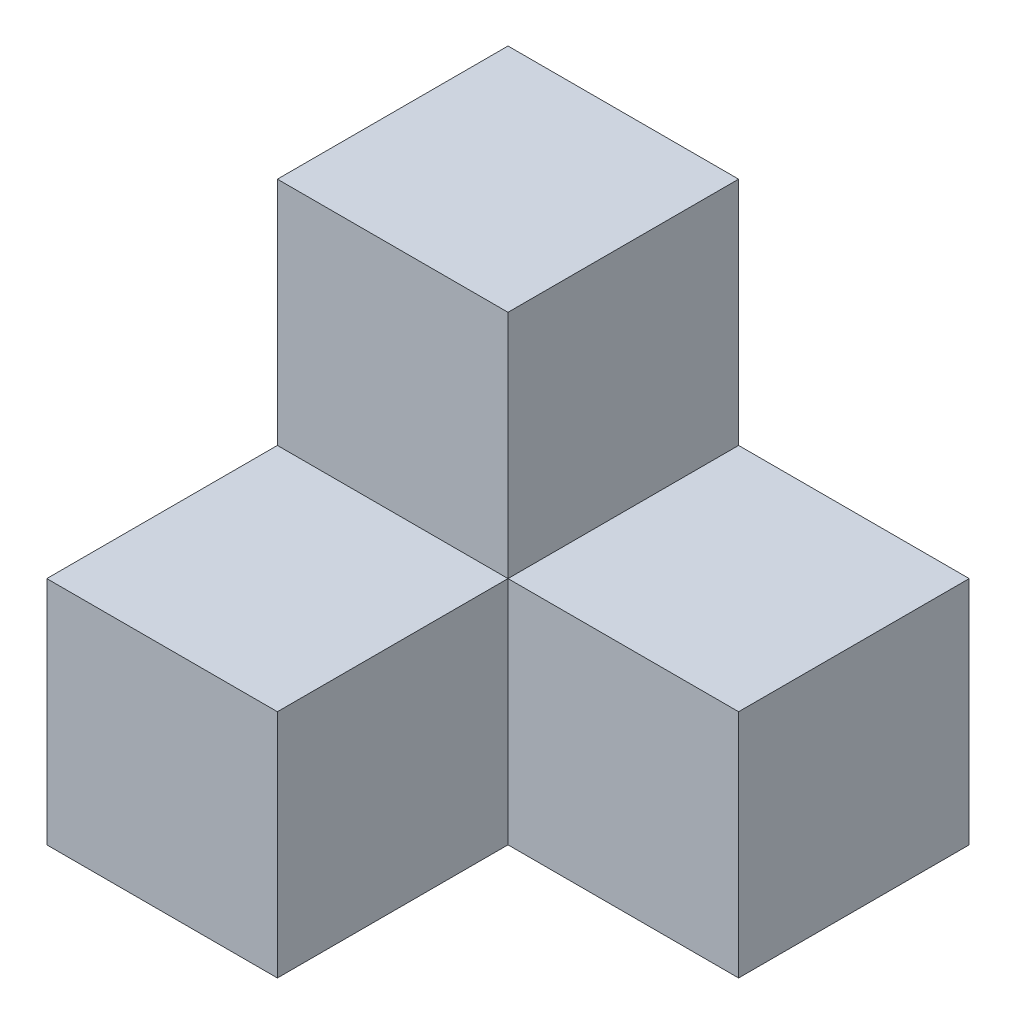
ISO-10303-21;
HEADER;
FILE_DESCRIPTION(('STEP AP214'),'2;1');
FILE_NAME('part.step','',(''),(''),'','','');
FILE_SCHEMA(('AUTOMOTIVE_DESIGN { 1 0 10303 214 1 1 1 1 }'));
ENDSEC;
DATA;
#1=APPLICATION_CONTEXT('core data for automotive mechanical design processes');
#2=APPLICATION_PROTOCOL_DEFINITION('international standard','automotive_design',2000,#1);
#3=PRODUCT_CONTEXT('',#1,'mechanical');
#4=PRODUCT('Part','Part','',(#3));
#5=PRODUCT_RELATED_PRODUCT_CATEGORY('part','',(#4));
#6=PRODUCT_DEFINITION_FORMATION('','',#4);
#7=PRODUCT_DEFINITION_CONTEXT('part definition',#1,'design');
#8=PRODUCT_DEFINITION('design','',#6,#7);
#9=PRODUCT_DEFINITION_SHAPE('','',#8);
#10=(LENGTH_UNIT() NAMED_UNIT(*) SI_UNIT(.MILLI.,.METRE.));
#11=(NAMED_UNIT(*) PLANE_ANGLE_UNIT() SI_UNIT($,.RADIAN.));
#12=(NAMED_UNIT(*) SI_UNIT($,.STERADIAN.) SOLID_ANGLE_UNIT());
#13=UNCERTAINTY_MEASURE_WITH_UNIT(LENGTH_MEASURE(1.E-05),#10,'distance_accuracy_value','');
#14=(GEOMETRIC_REPRESENTATION_CONTEXT(3) GLOBAL_UNCERTAINTY_ASSIGNED_CONTEXT((#13)) GLOBAL_UNIT_ASSIGNED_CONTEXT((#10,
#11,#12)) REPRESENTATION_CONTEXT('',''));
#15=CARTESIAN_POINT('',(0.,0.,0.));
#16=DIRECTION('',(0.,0.,1.));
#17=DIRECTION('',(1.,0.,0.));
#18=AXIS2_PLACEMENT_3D('',#15,#16,#17);
#19=CARTESIAN_POINT('',(0.,0.,5.));
#20=DIRECTION('',(0.,0.,-1.));
#21=DIRECTION('',(-1.,0.,0.));
#22=AXIS2_PLACEMENT_3D('',#19,#20,#21);
#23=PLANE('',#22);
#24=DIRECTION('',(0.,1.,0.));
#25=VECTOR('',#24,1.);
#26=CARTESIAN_POINT('',(0.,2.5,5.));
#27=LINE('',#26,#25);
#28=CARTESIAN_POINT('',(0.,-2.5,5.));
#29=VERTEX_POINT('',#28);
#30=CARTESIAN_POINT('',(0.,2.5,5.));
#31=VERTEX_POINT('',#30);
#32=EDGE_CURVE('E48',#29,#31,#27,.T.);
#33=ORIENTED_EDGE('',*,*,#32,.F.);
#34=DIRECTION('',(1.,0.,0.));
#35=VECTOR('',#34,1.);
#36=CARTESIAN_POINT('',(5.,-2.5,5.));
#37=LINE('',#36,#35);
#38=CARTESIAN_POINT('',(5.,-2.5,5.));
#39=VERTEX_POINT('',#38);
#40=EDGE_CURVE('E89',#29,#39,#37,.T.);
#41=ORIENTED_EDGE('',*,*,#40,.T.);
#42=DIRECTION('',(0.,1.,0.));
#43=VECTOR('',#42,1.);
#44=CARTESIAN_POINT('',(5.,-2.5,5.));
#45=LINE('',#44,#43);
#46=CARTESIAN_POINT('',(5.,2.5,5.));
#47=VERTEX_POINT('',#46);
#48=EDGE_CURVE('E114',#39,#47,#45,.T.);
#49=ORIENTED_EDGE('',*,*,#48,.T.);
#50=DIRECTION('',(-1.,0.,0.));
#51=VECTOR('',#50,1.);
#52=CARTESIAN_POINT('',(0.,2.5,5.));
#53=LINE('',#52,#51);
#54=EDGE_CURVE('E111',#47,#31,#53,.T.);
#55=ORIENTED_EDGE('',*,*,#54,.T.);
#56=EDGE_LOOP('',(#33,#41,#49,#55));
#57=FACE_BOUND('',#56,.T.);
#58=ADVANCED_FACE('F33',(#57),#23,.F.);
#59=DIRECTION('',(-1.,0.,0.));
#60=VECTOR('',#59,1.);
#61=CARTESIAN_POINT('',(0.,2.5,5.));
#62=LINE('',#61,#60);
#63=CARTESIAN_POINT('',(-5.,2.5,5.));
#64=VERTEX_POINT('',#63);
#65=EDGE_CURVE('E97',#31,#64,#62,.T.);
#66=ORIENTED_EDGE('',*,*,#65,.F.);
#67=DIRECTION('',(0.,1.,0.));
#68=VECTOR('',#67,1.);
#69=CARTESIAN_POINT('',(0.,2.5,5.));
#70=LINE('',#69,#68);
#71=CARTESIAN_POINT('',(0.,7.5,5.));
#72=VERTEX_POINT('',#71);
#73=EDGE_CURVE('E100',#31,#72,#70,.T.);
#74=ORIENTED_EDGE('',*,*,#73,.T.);
#75=DIRECTION('',(-1.,0.,0.));
#76=VECTOR('',#75,1.);
#77=CARTESIAN_POINT('',(-5.,7.5,5.));
#78=LINE('',#77,#76);
#79=CARTESIAN_POINT('',(-5.,7.5,5.));
#80=VERTEX_POINT('',#79);
#81=EDGE_CURVE('E57',#72,#80,#78,.T.);
#82=ORIENTED_EDGE('',*,*,#81,.T.);
#83=DIRECTION('',(0.,-1.,0.));
#84=VECTOR('',#83,1.);
#85=CARTESIAN_POINT('',(-5.,2.5,5.));
#86=LINE('',#85,#84);
#87=EDGE_CURVE('E103',#80,#64,#86,.T.);
#88=ORIENTED_EDGE('',*,*,#87,.T.);
#89=EDGE_LOOP('',(#66,#74,#82,#88));
#90=FACE_BOUND('',#89,.T.);
#91=ADVANCED_FACE('F98',(#90),#23,.F.);
#92=CARTESIAN_POINT('',(-5.,-2.5,5.));
#93=DIRECTION('',(1.,0.,0.));
#94=DIRECTION('',(0.,0.,-1.));
#95=AXIS2_PLACEMENT_3D('',#92,#93,#94);
#96=PLANE('',#95);
#97=DIRECTION('',(0.,-1.,0.));
#98=VECTOR('',#97,1.);
#99=CARTESIAN_POINT('',(-5.,-2.5,0.));
#100=LINE('',#99,#98);
#101=CARTESIAN_POINT('',(-5.,7.5,0.));
#102=VERTEX_POINT('',#101);
#103=CARTESIAN_POINT('',(-5.,-2.5,0.));
#104=VERTEX_POINT('',#103);
#105=EDGE_CURVE('E84',#102,#104,#100,.T.);
#106=ORIENTED_EDGE('',*,*,#105,.T.);
#107=DIRECTION('',(0.,0.,-1.));
#108=VECTOR('',#107,1.);
#109=CARTESIAN_POINT('',(-5.,-2.5,5.));
#110=LINE('',#109,#108);
#111=CARTESIAN_POINT('',(-5.,-2.5,10.));
#112=VERTEX_POINT('',#111);
#113=EDGE_CURVE('E11',#112,#104,#110,.T.);
#114=ORIENTED_EDGE('',*,*,#113,.F.);
#115=DIRECTION('',(0.,-1.,0.));
#116=VECTOR('',#115,1.);
#117=CARTESIAN_POINT('',(-5.,2.5,10.));
#118=LINE('',#117,#116);
#119=CARTESIAN_POINT('',(-5.,2.5,10.));
#120=VERTEX_POINT('',#119);
#121=EDGE_CURVE('E186',#120,#112,#118,.T.);
#122=ORIENTED_EDGE('',*,*,#121,.F.);
#123=DIRECTION('',(0.,0.,-1.));
#124=VECTOR('',#123,1.);
#125=CARTESIAN_POINT('',(-5.,2.5,10.));
#126=LINE('',#125,#124);
#127=EDGE_CURVE('E142',#120,#64,#126,.T.);
#128=ORIENTED_EDGE('',*,*,#127,.T.);
#129=ORIENTED_EDGE('',*,*,#87,.F.);
#130=DIRECTION('',(0.,0.,-1.));
#131=VECTOR('',#130,1.);
#132=CARTESIAN_POINT('',(-5.,7.5,5.));
#133=LINE('',#132,#131);
#134=EDGE_CURVE('E160',#80,#102,#133,.T.);
#135=ORIENTED_EDGE('',*,*,#134,.T.);
#136=EDGE_LOOP('',(#106,#114,#122,#128,#129,#135));
#137=FACE_BOUND('',#136,.T.);
#138=ADVANCED_FACE('F35',(#137),#96,.F.);
#139=CARTESIAN_POINT('',(5.,-2.5,5.));
#140=DIRECTION('',(0.,1.,0.));
#141=DIRECTION('',(-1.,0.,0.));
#142=AXIS2_PLACEMENT_3D('',#139,#140,#141);
#143=PLANE('',#142);
#144=DIRECTION('',(1.,0.,0.));
#145=VECTOR('',#144,1.);
#146=CARTESIAN_POINT('',(5.,-2.5,0.));
#147=LINE('',#146,#145);
#148=CARTESIAN_POINT('',(5.,-2.5,0.));
#149=VERTEX_POINT('',#148);
#150=EDGE_CURVE('E162',#104,#149,#147,.T.);
#151=ORIENTED_EDGE('',*,*,#150,.T.);
#152=DIRECTION('',(0.,0.,-1.));
#153=VECTOR('',#152,1.);
#154=CARTESIAN_POINT('',(5.,-2.5,5.));
#155=LINE('',#154,#153);
#156=EDGE_CURVE('E41',#39,#149,#155,.T.);
#157=ORIENTED_EDGE('',*,*,#156,.F.);
#158=ORIENTED_EDGE('',*,*,#40,.F.);
#159=DIRECTION('',(0.,0.,-1.));
#160=VECTOR('',#159,1.);
#161=CARTESIAN_POINT('',(0.,-2.5,10.));
#162=LINE('',#161,#160);
#163=CARTESIAN_POINT('',(0.,-2.5,10.));
#164=VERTEX_POINT('',#163);
#165=EDGE_CURVE('E147',#164,#29,#162,.T.);
#166=ORIENTED_EDGE('',*,*,#165,.F.);
#167=DIRECTION('',(1.,0.,0.));
#168=VECTOR('',#167,1.);
#169=CARTESIAN_POINT('',(0.,-2.5,10.));
#170=LINE('',#169,#168);
#171=EDGE_CURVE('E150',#112,#164,#170,.T.);
#172=ORIENTED_EDGE('',*,*,#171,.F.);
#173=ORIENTED_EDGE('',*,*,#113,.T.);
#174=EDGE_LOOP('',(#151,#157,#158,#166,#172,#173));
#175=FACE_BOUND('',#174,.T.);
#176=ADVANCED_FACE('F195',(#175),#143,.F.);
#177=CARTESIAN_POINT('',(5.,-2.5,5.));
#178=DIRECTION('',(-1.,0.,0.));
#179=DIRECTION('',(0.,0.,1.));
#180=AXIS2_PLACEMENT_3D('',#177,#178,#179);
#181=PLANE('',#180);
#182=DIRECTION('',(0.,1.,0.));
#183=VECTOR('',#182,1.);
#184=CARTESIAN_POINT('',(5.,-2.5,0.));
#185=LINE('',#184,#183);
#186=CARTESIAN_POINT('',(5.,2.5,0.));
#187=VERTEX_POINT('',#186);
#188=EDGE_CURVE('E164',#149,#187,#185,.T.);
#189=ORIENTED_EDGE('',*,*,#188,.T.);
#190=DIRECTION('',(0.,0.,-1.));
#191=VECTOR('',#190,1.);
#192=CARTESIAN_POINT('',(5.,2.5,5.));
#193=LINE('',#192,#191);
#194=EDGE_CURVE('E126',#47,#187,#193,.T.);
#195=ORIENTED_EDGE('',*,*,#194,.F.);
#196=ORIENTED_EDGE('',*,*,#48,.F.);
#197=ORIENTED_EDGE('',*,*,#156,.T.);
#198=EDGE_LOOP('',(#189,#195,#196,#197));
#199=FACE_BOUND('',#198,.T.);
#200=ADVANCED_FACE('F176',(#199),#181,.F.);
#201=CARTESIAN_POINT('',(0.,2.5,5.));
#202=DIRECTION('',(0.,-1.,0.));
#203=DIRECTION('',(1.,0.,0.));
#204=AXIS2_PLACEMENT_3D('',#201,#202,#203);
#205=PLANE('',#204);
#206=DIRECTION('',(-1.,0.,0.));
#207=VECTOR('',#206,1.);
#208=CARTESIAN_POINT('',(0.,2.5,0.));
#209=LINE('',#208,#207);
#210=CARTESIAN_POINT('',(0.,2.5,0.));
#211=VERTEX_POINT('',#210);
#212=EDGE_CURVE('E123',#187,#211,#209,.T.);
#213=ORIENTED_EDGE('',*,*,#212,.T.);
#214=DIRECTION('',(0.,0.,-1.));
#215=VECTOR('',#214,1.);
#216=CARTESIAN_POINT('',(0.,2.5,5.));
#217=LINE('',#216,#215);
#218=EDGE_CURVE('E120',#31,#211,#217,.T.);
#219=ORIENTED_EDGE('',*,*,#218,.F.);
#220=ORIENTED_EDGE('',*,*,#54,.F.);
#221=ORIENTED_EDGE('',*,*,#194,.T.);
#222=EDGE_LOOP('',(#213,#219,#220,#221));
#223=FACE_BOUND('',#222,.T.);
#224=ADVANCED_FACE('F121',(#223),#205,.F.);
#225=CARTESIAN_POINT('',(0.,2.5,5.));
#226=DIRECTION('',(-1.,0.,0.));
#227=DIRECTION('',(0.,0.,1.));
#228=AXIS2_PLACEMENT_3D('',#225,#226,#227);
#229=PLANE('',#228);
#230=DIRECTION('',(0.,1.,0.));
#231=VECTOR('',#230,1.);
#232=CARTESIAN_POINT('',(0.,2.5,0.));
#233=LINE('',#232,#231);
#234=CARTESIAN_POINT('',(0.,7.5,0.));
#235=VERTEX_POINT('',#234);
#236=EDGE_CURVE('E167',#211,#235,#233,.T.);
#237=ORIENTED_EDGE('',*,*,#236,.T.);
#238=DIRECTION('',(0.,0.,-1.));
#239=VECTOR('',#238,1.);
#240=CARTESIAN_POINT('',(0.,7.5,5.));
#241=LINE('',#240,#239);
#242=EDGE_CURVE('E127',#72,#235,#241,.T.);
#243=ORIENTED_EDGE('',*,*,#242,.F.);
#244=ORIENTED_EDGE('',*,*,#73,.F.);
#245=ORIENTED_EDGE('',*,*,#218,.T.);
#246=EDGE_LOOP('',(#237,#243,#244,#245));
#247=FACE_BOUND('',#246,.T.);
#248=ADVANCED_FACE('F129',(#247),#229,.F.);
#249=CARTESIAN_POINT('',(-5.,7.5,5.));
#250=DIRECTION('',(0.,-1.,0.));
#251=DIRECTION('',(0.,0.,-1.));
#252=AXIS2_PLACEMENT_3D('',#249,#250,#251);
#253=PLANE('',#252);
#254=DIRECTION('',(-1.,0.,0.));
#255=VECTOR('',#254,1.);
#256=CARTESIAN_POINT('',(-5.,7.5,0.));
#257=LINE('',#256,#255);
#258=EDGE_CURVE('E156',#235,#102,#257,.T.);
#259=ORIENTED_EDGE('',*,*,#258,.T.);
#260=ORIENTED_EDGE('',*,*,#134,.F.);
#261=ORIENTED_EDGE('',*,*,#81,.F.);
#262=ORIENTED_EDGE('',*,*,#242,.T.);
#263=EDGE_LOOP('',(#259,#260,#261,#262));
#264=FACE_BOUND('',#263,.T.);
#265=ADVANCED_FACE('F180',(#264),#253,.F.);
#266=CARTESIAN_POINT('',(0.,0.,0.));
#267=DIRECTION('',(0.,0.,-1.));
#268=DIRECTION('',(-1.,0.,0.));
#269=AXIS2_PLACEMENT_3D('',#266,#267,#268);
#270=PLANE('',#269);
#271=ORIENTED_EDGE('',*,*,#105,.F.);
#272=ORIENTED_EDGE('',*,*,#258,.F.);
#273=ORIENTED_EDGE('',*,*,#236,.F.);
#274=ORIENTED_EDGE('',*,*,#212,.F.);
#275=ORIENTED_EDGE('',*,*,#188,.F.);
#276=ORIENTED_EDGE('',*,*,#150,.F.);
#277=EDGE_LOOP('',(#271,#272,#273,#274,#275,#276));
#278=FACE_BOUND('',#277,.T.);
#279=ADVANCED_FACE('F178',(#278),#270,.T.);
#280=CARTESIAN_POINT('',(0.,2.5,10.));
#281=DIRECTION('',(-1.,0.,0.));
#282=DIRECTION('',(0.,0.,1.));
#283=AXIS2_PLACEMENT_3D('',#280,#281,#282);
#284=PLANE('',#283);
#285=ORIENTED_EDGE('',*,*,#32,.T.);
#286=DIRECTION('',(0.,0.,-1.));
#287=VECTOR('',#286,1.);
#288=CARTESIAN_POINT('',(0.,2.5,10.));
#289=LINE('',#288,#287);
#290=CARTESIAN_POINT('',(0.,2.5,10.));
#291=VERTEX_POINT('',#290);
#292=EDGE_CURVE('E134',#291,#31,#289,.T.);
#293=ORIENTED_EDGE('',*,*,#292,.F.);
#294=DIRECTION('',(0.,1.,0.));
#295=VECTOR('',#294,1.);
#296=CARTESIAN_POINT('',(0.,2.5,10.));
#297=LINE('',#296,#295);
#298=EDGE_CURVE('E108',#164,#291,#297,.T.);
#299=ORIENTED_EDGE('',*,*,#298,.F.);
#300=ORIENTED_EDGE('',*,*,#165,.T.);
#301=EDGE_LOOP('',(#285,#293,#299,#300));
#302=FACE_BOUND('',#301,.T.);
#303=ADVANCED_FACE('F145',(#302),#284,.F.);
#304=CARTESIAN_POINT('',(0.,2.5,10.));
#305=DIRECTION('',(0.,-1.,0.));
#306=DIRECTION('',(0.,0.,-1.));
#307=AXIS2_PLACEMENT_3D('',#304,#305,#306);
#308=PLANE('',#307);
#309=ORIENTED_EDGE('',*,*,#65,.T.);
#310=ORIENTED_EDGE('',*,*,#127,.F.);
#311=DIRECTION('',(-1.,0.,0.));
#312=VECTOR('',#311,1.);
#313=CARTESIAN_POINT('',(0.,2.5,10.));
#314=LINE('',#313,#312);
#315=EDGE_CURVE('E138',#291,#120,#314,.T.);
#316=ORIENTED_EDGE('',*,*,#315,.F.);
#317=ORIENTED_EDGE('',*,*,#292,.T.);
#318=EDGE_LOOP('',(#309,#310,#316,#317));
#319=FACE_BOUND('',#318,.T.);
#320=ADVANCED_FACE('F135',(#319),#308,.F.);
#321=CARTESIAN_POINT('',(0.,0.,10.));
#322=DIRECTION('',(0.,0.,-1.));
#323=DIRECTION('',(-1.,0.,0.));
#324=AXIS2_PLACEMENT_3D('',#321,#322,#323);
#325=PLANE('',#324);
#326=ORIENTED_EDGE('',*,*,#298,.T.);
#327=ORIENTED_EDGE('',*,*,#315,.T.);
#328=ORIENTED_EDGE('',*,*,#121,.T.);
#329=ORIENTED_EDGE('',*,*,#171,.T.);
#330=EDGE_LOOP('',(#326,#327,#328,#329));
#331=FACE_BOUND('',#330,.T.);
#332=ADVANCED_FACE('F194',(#331),#325,.F.);
#333=CLOSED_SHELL('',(#58,#91,#138,#176,#200,#224,#248,#265,#279,#303,#320,#332));
#334=MANIFOLD_SOLID_BREP('B2',#333);
#335=ADVANCED_BREP_SHAPE_REPRESENTATION('',(#18,#334),#14);
#336=SHAPE_DEFINITION_REPRESENTATION(#9,#335);
ENDSEC;
END-ISO-10303-21;
